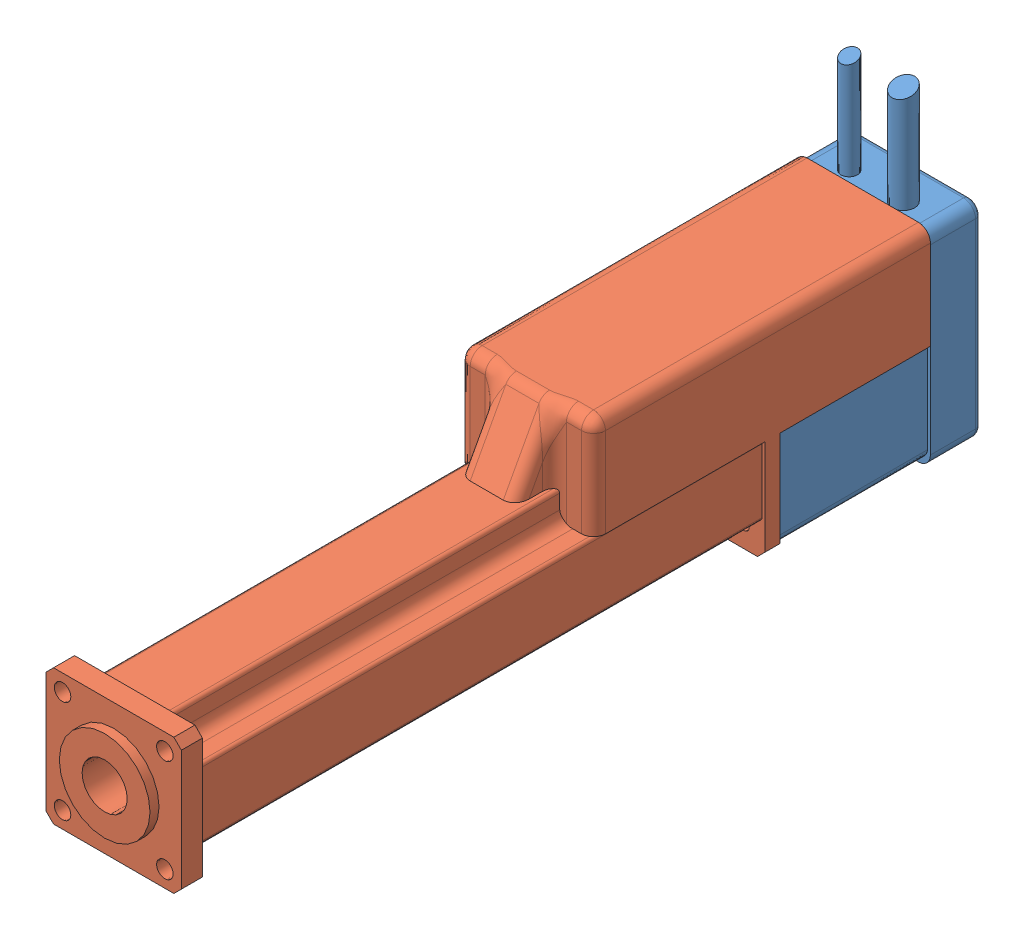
SolidWorks assembly corps_verin.SLDASM, configuration Défaut (file format 4400). Lengths in mm.
Overall size (45 102.68 269).
2 component instances, 2 part files, 3 mates.
Components (placement in the parent):
- RSA04-1: RSA04.sldprt [Défaut] at (-95.9835 24.6976 97.5002) size (44 102.68 87.5)
- prt-SCN5-150-2: prt-SCN5-150.sldprt [Défaut] at (-96.4835 25.1976 97.5002) size (45 68.14 252)
Mates (geometry in assembly coordinates):
- Coïncidente8: coincident: plane of RSA04-1 through (-95.9835 24.6976 97.5002) normal (0 0 1); plane of prt-SCN5-150-2 through (-96.4835 25.1976 97.5002) normal (0 0 -1)
- Coïncidente9: coincident: plane of RSA04-1 through (-113.9835 3.6976 97.5002) normal (0 -1 0); plane of prt-SCN5-150-2 through (-96.4835 3.6976 102.5002) normal (0 -1 0)
- Coïncidente10: coincident aligned: plane of RSA04-1 through (-74.9835 6.6976 97.5002) normal (1 0 0); plane of prt-SCN5-150-2 through (-74.9835 25.1976 102.5002) normal (1 0 0)
